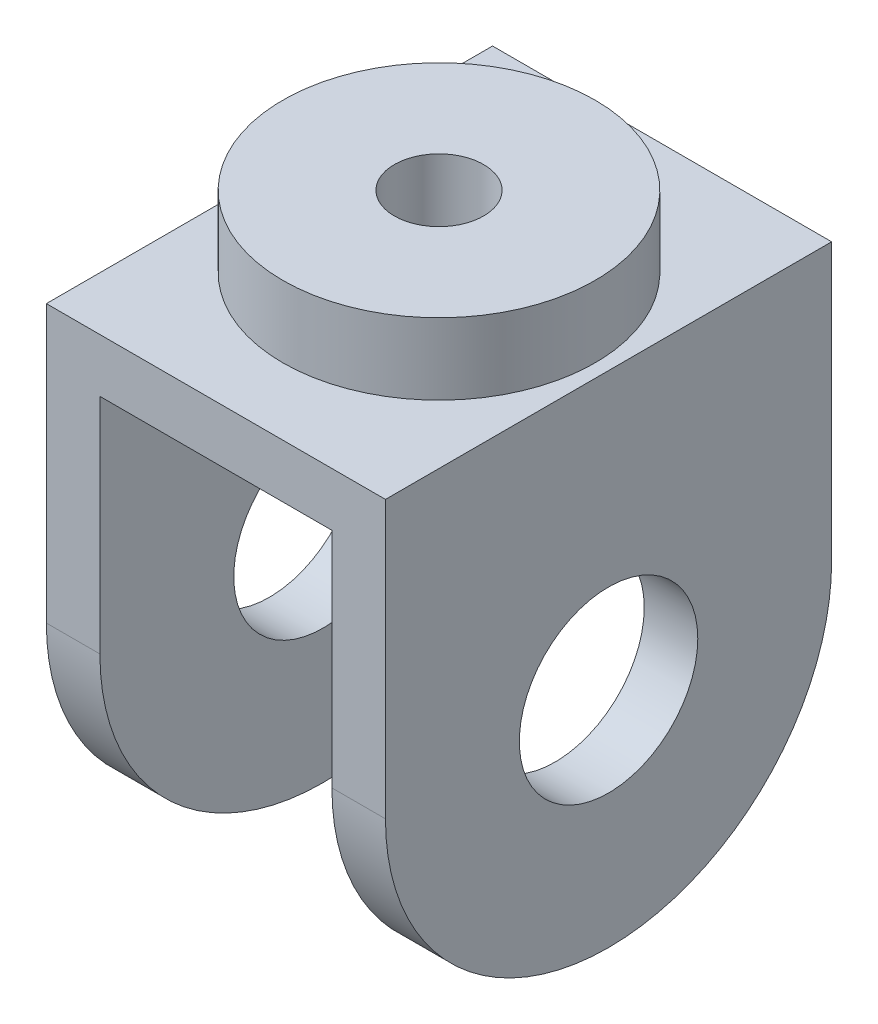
ISO-10303-21;
HEADER;
FILE_DESCRIPTION(('STEP AP214'),'2;1');
FILE_NAME('part.step','',(''),(''),'','','');
FILE_SCHEMA(('AUTOMOTIVE_DESIGN { 1 0 10303 214 1 1 1 1 }'));
ENDSEC;
DATA;
#1=APPLICATION_CONTEXT('core data for automotive mechanical design processes');
#2=APPLICATION_PROTOCOL_DEFINITION('international standard','automotive_design',2000,#1);
#3=PRODUCT_CONTEXT('',#1,'mechanical');
#4=PRODUCT('Part','Part','',(#3));
#5=PRODUCT_RELATED_PRODUCT_CATEGORY('part','',(#4));
#6=PRODUCT_DEFINITION_FORMATION('','',#4);
#7=PRODUCT_DEFINITION_CONTEXT('part definition',#1,'design');
#8=PRODUCT_DEFINITION('design','',#6,#7);
#9=PRODUCT_DEFINITION_SHAPE('','',#8);
#10=(LENGTH_UNIT() NAMED_UNIT(*) SI_UNIT(.MILLI.,.METRE.));
#11=(NAMED_UNIT(*) PLANE_ANGLE_UNIT() SI_UNIT($,.RADIAN.));
#12=(NAMED_UNIT(*) SI_UNIT($,.STERADIAN.) SOLID_ANGLE_UNIT());
#13=UNCERTAINTY_MEASURE_WITH_UNIT(LENGTH_MEASURE(1.E-05),#10,'distance_accuracy_value','');
#14=(GEOMETRIC_REPRESENTATION_CONTEXT(3) GLOBAL_UNCERTAINTY_ASSIGNED_CONTEXT((#13)) GLOBAL_UNIT_ASSIGNED_CONTEXT((#10,
#11,#12)) REPRESENTATION_CONTEXT('',''));
#15=CARTESIAN_POINT('',(0.,0.,0.));
#16=DIRECTION('',(0.,0.,1.));
#17=DIRECTION('',(1.,0.,0.));
#18=AXIS2_PLACEMENT_3D('',#15,#16,#17);
#19=CARTESIAN_POINT('',(0.,25.,0.));
#20=DIRECTION('',(0.,1.,0.));
#21=DIRECTION('',(0.,0.,1.));
#22=AXIS2_PLACEMENT_3D('',#19,#20,#21);
#23=PLANE('',#22);
#24=CARTESIAN_POINT('',(-13.,25.,0.));
#25=DIRECTION('',(0.,1.,0.));
#26=DIRECTION('',(0.,0.,1.));
#27=AXIS2_PLACEMENT_3D('',#24,#25,#26);
#28=CIRCLE('',#27,5.);
#29=CARTESIAN_POINT('',(-13.,25.,5.));
#30=VERTEX_POINT('',#29);
#31=EDGE_CURVE('E380',#30,#30,#28,.T.);
#32=ORIENTED_EDGE('',*,*,#31,.T.);
#33=EDGE_LOOP('',(#32));
#34=FACE_BOUND('',#33,.T.);
#35=DIRECTION('',(0.,0.,1.));
#36=VECTOR('',#35,1.);
#37=CARTESIAN_POINT('',(-26.,25.,25.));
#38=LINE('',#37,#36);
#39=CARTESIAN_POINT('',(-26.,25.,-25.));
#40=VERTEX_POINT('',#39);
#41=CARTESIAN_POINT('',(-26.,25.,25.));
#42=VERTEX_POINT('',#41);
#43=EDGE_CURVE('E307',#40,#42,#38,.T.);
#44=ORIENTED_EDGE('',*,*,#43,.F.);
#45=DIRECTION('',(-1.,0.,0.));
#46=VECTOR('',#45,1.);
#47=CARTESIAN_POINT('',(6.,25.,-25.));
#48=LINE('',#47,#46);
#49=CARTESIAN_POINT('',(0.,25.,-25.));
#50=VERTEX_POINT('',#49);
#51=EDGE_CURVE('E369',#50,#40,#48,.T.);
#52=ORIENTED_EDGE('',*,*,#51,.F.);
#53=DIRECTION('',(0.,0.,1.));
#54=VECTOR('',#53,1.);
#55=CARTESIAN_POINT('',(0.,25.,25.));
#56=LINE('',#55,#54);
#57=CARTESIAN_POINT('',(0.,25.,25.));
#58=VERTEX_POINT('',#57);
#59=EDGE_CURVE('E353',#50,#58,#56,.T.);
#60=ORIENTED_EDGE('',*,*,#59,.T.);
#61=DIRECTION('',(1.,0.,0.));
#62=VECTOR('',#61,1.);
#63=CARTESIAN_POINT('',(6.,25.,25.));
#64=LINE('',#63,#62);
#65=EDGE_CURVE('E368',#42,#58,#64,.T.);
#66=ORIENTED_EDGE('',*,*,#65,.F.);
#67=EDGE_LOOP('',(#44,#52,#60,#66));
#68=FACE_BOUND('',#67,.T.);
#69=ADVANCED_FACE('F292',(#34,#68),#23,.F.);
#70=CARTESIAN_POINT('',(6.,0.,0.));
#71=DIRECTION('',(1.,0.,0.));
#72=DIRECTION('',(0.,0.,-1.));
#73=AXIS2_PLACEMENT_3D('',#70,#71,#72);
#74=PLANE('',#73);
#75=DIRECTION('',(0.,1.,0.));
#76=VECTOR('',#75,1.);
#77=CARTESIAN_POINT('',(6.,0.,-25.));
#78=LINE('',#77,#76);
#79=CARTESIAN_POINT('',(6.,0.,-25.));
#80=VERTEX_POINT('',#79);
#81=CARTESIAN_POINT('',(6.,31.,-25.));
#82=VERTEX_POINT('',#81);
#83=EDGE_CURVE('E341',#80,#82,#78,.T.);
#84=ORIENTED_EDGE('',*,*,#83,.T.);
#85=DIRECTION('',(0.,0.,-1.));
#86=VECTOR('',#85,1.);
#87=CARTESIAN_POINT('',(6.,31.,25.));
#88=LINE('',#87,#86);
#89=CARTESIAN_POINT('',(6.,31.,25.));
#90=VERTEX_POINT('',#89);
#91=EDGE_CURVE('E372',#90,#82,#88,.T.);
#92=ORIENTED_EDGE('',*,*,#91,.F.);
#93=DIRECTION('',(0.,-1.,0.));
#94=VECTOR('',#93,1.);
#95=CARTESIAN_POINT('',(6.,0.,25.));
#96=LINE('',#95,#94);
#97=CARTESIAN_POINT('',(6.,0.,25.));
#98=VERTEX_POINT('',#97);
#99=EDGE_CURVE('E393',#90,#98,#96,.T.);
#100=ORIENTED_EDGE('',*,*,#99,.T.);
#101=CARTESIAN_POINT('',(6.,0.,0.));
#102=DIRECTION('',(1.,0.,0.));
#103=DIRECTION('',(0.,0.,-1.));
#104=AXIS2_PLACEMENT_3D('',#101,#102,#103);
#105=CIRCLE('',#104,25.);
#106=EDGE_CURVE('E316',#98,#80,#105,.T.);
#107=ORIENTED_EDGE('',*,*,#106,.T.);
#108=EDGE_LOOP('',(#84,#92,#100,#107));
#109=FACE_BOUND('',#108,.T.);
#110=CARTESIAN_POINT('',(6.,0.,0.));
#111=DIRECTION('',(1.,0.,0.));
#112=DIRECTION('',(0.,0.,-1.));
#113=AXIS2_PLACEMENT_3D('',#110,#111,#112);
#114=CIRCLE('',#113,10.);
#115=CARTESIAN_POINT('',(6.,0.,-10.));
#116=VERTEX_POINT('',#115);
#117=EDGE_CURVE('E355',#116,#116,#114,.T.);
#118=ORIENTED_EDGE('',*,*,#117,.F.);
#119=EDGE_LOOP('',(#118));
#120=FACE_BOUND('',#119,.T.);
#121=ADVANCED_FACE('F391',(#109,#120),#74,.T.);
#122=CARTESIAN_POINT('',(0.,0.,0.));
#123=DIRECTION('',(1.,0.,0.));
#124=DIRECTION('',(0.,0.,-1.));
#125=AXIS2_PLACEMENT_3D('',#122,#123,#124);
#126=PLANE('',#125);
#127=DIRECTION('',(0.,1.,0.));
#128=VECTOR('',#127,1.);
#129=CARTESIAN_POINT('',(0.,0.,-25.));
#130=LINE('',#129,#128);
#131=CARTESIAN_POINT('',(0.,0.,-25.));
#132=VERTEX_POINT('',#131);
#133=EDGE_CURVE('E347',#132,#50,#130,.T.);
#134=ORIENTED_EDGE('',*,*,#133,.F.);
#135=CARTESIAN_POINT('',(0.,0.,0.));
#136=DIRECTION('',(1.,0.,0.));
#137=DIRECTION('',(0.,0.,-1.));
#138=AXIS2_PLACEMENT_3D('',#135,#136,#137);
#139=CIRCLE('',#138,25.);
#140=CARTESIAN_POINT('',(0.,0.,25.));
#141=VERTEX_POINT('',#140);
#142=EDGE_CURVE('E335',#141,#132,#139,.T.);
#143=ORIENTED_EDGE('',*,*,#142,.F.);
#144=DIRECTION('',(0.,-1.,0.));
#145=VECTOR('',#144,1.);
#146=CARTESIAN_POINT('',(0.,0.,25.));
#147=LINE('',#146,#145);
#148=EDGE_CURVE('E345',#58,#141,#147,.T.);
#149=ORIENTED_EDGE('',*,*,#148,.F.);
#150=ORIENTED_EDGE('',*,*,#59,.F.);
#151=EDGE_LOOP('',(#134,#143,#149,#150));
#152=FACE_BOUND('',#151,.T.);
#153=CARTESIAN_POINT('',(0.,0.,0.));
#154=DIRECTION('',(1.,0.,0.));
#155=DIRECTION('',(0.,0.,-1.));
#156=AXIS2_PLACEMENT_3D('',#153,#154,#155);
#157=CIRCLE('',#156,10.);
#158=CARTESIAN_POINT('',(0.,0.,-10.));
#159=VERTEX_POINT('',#158);
#160=EDGE_CURVE('E356',#159,#159,#157,.T.);
#161=ORIENTED_EDGE('',*,*,#160,.T.);
#162=EDGE_LOOP('',(#161));
#163=FACE_BOUND('',#162,.T.);
#164=ADVANCED_FACE('F346',(#152,#163),#126,.F.);
#165=CARTESIAN_POINT('',(6.,0.,-25.));
#166=DIRECTION('',(0.,0.,1.));
#167=DIRECTION('',(0.,-1.,0.));
#168=AXIS2_PLACEMENT_3D('',#165,#166,#167);
#169=PLANE('',#168);
#170=ORIENTED_EDGE('',*,*,#133,.T.);
#171=ORIENTED_EDGE('',*,*,#51,.T.);
#172=DIRECTION('',(0.,1.,0.));
#173=VECTOR('',#172,1.);
#174=CARTESIAN_POINT('',(-26.,0.,-25.));
#175=LINE('',#174,#173);
#176=CARTESIAN_POINT('',(-26.,0.,-25.));
#177=VERTEX_POINT('',#176);
#178=EDGE_CURVE('E431',#177,#40,#175,.T.);
#179=ORIENTED_EDGE('',*,*,#178,.F.);
#180=DIRECTION('',(1.,0.,0.));
#181=VECTOR('',#180,1.);
#182=CARTESIAN_POINT('',(-32.,0.,-25.));
#183=LINE('',#182,#181);
#184=CARTESIAN_POINT('',(-32.,0.,-25.));
#185=VERTEX_POINT('',#184);
#186=EDGE_CURVE('E417',#185,#177,#183,.T.);
#187=ORIENTED_EDGE('',*,*,#186,.F.);
#188=DIRECTION('',(0.,-1.,0.));
#189=VECTOR('',#188,1.);
#190=CARTESIAN_POINT('',(-32.,31.,-25.));
#191=LINE('',#190,#189);
#192=CARTESIAN_POINT('',(-32.,31.,-25.));
#193=VERTEX_POINT('',#192);
#194=EDGE_CURVE('E387',#193,#185,#191,.T.);
#195=ORIENTED_EDGE('',*,*,#194,.F.);
#196=DIRECTION('',(-1.,0.,0.));
#197=VECTOR('',#196,1.);
#198=CARTESIAN_POINT('',(6.,31.,-25.));
#199=LINE('',#198,#197);
#200=EDGE_CURVE('E406',#82,#193,#199,.T.);
#201=ORIENTED_EDGE('',*,*,#200,.F.);
#202=ORIENTED_EDGE('',*,*,#83,.F.);
#203=DIRECTION('',(-1.,0.,0.));
#204=VECTOR('',#203,1.);
#205=CARTESIAN_POINT('',(6.,0.,-25.));
#206=LINE('',#205,#204);
#207=EDGE_CURVE('E333',#80,#132,#206,.T.);
#208=ORIENTED_EDGE('',*,*,#207,.T.);
#209=EDGE_LOOP('',(#170,#171,#179,#187,#195,#201,#202,#208));
#210=FACE_BOUND('',#209,.T.);
#211=ADVANCED_FACE('F291',(#210),#169,.F.);
#212=CARTESIAN_POINT('',(6.,0.,25.));
#213=DIRECTION('',(0.,0.,-1.));
#214=DIRECTION('',(-1.,0.,0.));
#215=AXIS2_PLACEMENT_3D('',#212,#213,#214);
#216=PLANE('',#215);
#217=ORIENTED_EDGE('',*,*,#148,.T.);
#218=DIRECTION('',(-1.,0.,0.));
#219=VECTOR('',#218,1.);
#220=CARTESIAN_POINT('',(6.,0.,25.));
#221=LINE('',#220,#219);
#222=EDGE_CURVE('E293',#98,#141,#221,.T.);
#223=ORIENTED_EDGE('',*,*,#222,.F.);
#224=ORIENTED_EDGE('',*,*,#99,.F.);
#225=DIRECTION('',(1.,0.,0.));
#226=VECTOR('',#225,1.);
#227=CARTESIAN_POINT('',(6.,31.,25.));
#228=LINE('',#227,#226);
#229=CARTESIAN_POINT('',(-32.,31.,25.));
#230=VERTEX_POINT('',#229);
#231=EDGE_CURVE('E379',#230,#90,#228,.T.);
#232=ORIENTED_EDGE('',*,*,#231,.F.);
#233=DIRECTION('',(0.,-1.,0.));
#234=VECTOR('',#233,1.);
#235=CARTESIAN_POINT('',(-32.,31.,25.));
#236=LINE('',#235,#234);
#237=CARTESIAN_POINT('',(-32.,0.,25.));
#238=VERTEX_POINT('',#237);
#239=EDGE_CURVE('E382',#230,#238,#236,.T.);
#240=ORIENTED_EDGE('',*,*,#239,.T.);
#241=DIRECTION('',(1.,0.,0.));
#242=VECTOR('',#241,1.);
#243=CARTESIAN_POINT('',(-32.,0.,25.));
#244=LINE('',#243,#242);
#245=CARTESIAN_POINT('',(-26.,0.,25.));
#246=VERTEX_POINT('',#245);
#247=EDGE_CURVE('E419',#238,#246,#244,.T.);
#248=ORIENTED_EDGE('',*,*,#247,.T.);
#249=DIRECTION('',(0.,-1.,0.));
#250=VECTOR('',#249,1.);
#251=CARTESIAN_POINT('',(-26.,0.,25.));
#252=LINE('',#251,#250);
#253=EDGE_CURVE('E422',#42,#246,#252,.T.);
#254=ORIENTED_EDGE('',*,*,#253,.F.);
#255=ORIENTED_EDGE('',*,*,#65,.T.);
#256=EDGE_LOOP('',(#217,#223,#224,#232,#240,#248,#254,#255));
#257=FACE_BOUND('',#256,.T.);
#258=ADVANCED_FACE('F361',(#257),#216,.F.);
#259=CARTESIAN_POINT('',(6.,0.,0.));
#260=DIRECTION('',(-1.,0.,0.));
#261=DIRECTION('',(0.,0.,1.));
#262=AXIS2_PLACEMENT_3D('',#259,#260,#261);
#263=CYLINDRICAL_SURFACE('',#262,25.);
#264=ORIENTED_EDGE('',*,*,#142,.T.);
#265=ORIENTED_EDGE('',*,*,#207,.F.);
#266=ORIENTED_EDGE('',*,*,#106,.F.);
#267=ORIENTED_EDGE('',*,*,#222,.T.);
#268=EDGE_LOOP('',(#264,#265,#266,#267));
#269=FACE_BOUND('',#268,.T.);
#270=ADVANCED_FACE('F331',(#269),#263,.T.);
#271=CARTESIAN_POINT('',(6.,0.,0.));
#272=DIRECTION('',(-1.,0.,0.));
#273=DIRECTION('',(0.,0.,1.));
#274=AXIS2_PLACEMENT_3D('',#271,#272,#273);
#275=CYLINDRICAL_SURFACE('',#274,10.);
#276=ORIENTED_EDGE('',*,*,#117,.T.);
#277=EDGE_LOOP('',(#276));
#278=FACE_BOUND('',#277,.T.);
#279=ORIENTED_EDGE('',*,*,#160,.F.);
#280=EDGE_LOOP('',(#279));
#281=FACE_BOUND('',#280,.T.);
#282=ADVANCED_FACE('F500',(#278,#281),#275,.F.);
#283=CARTESIAN_POINT('',(-32.,31.,25.));
#284=DIRECTION('',(1.,0.,0.));
#285=DIRECTION('',(0.,0.,-1.));
#286=AXIS2_PLACEMENT_3D('',#283,#284,#285);
#287=PLANE('',#286);
#288=ORIENTED_EDGE('',*,*,#194,.T.);
#289=CARTESIAN_POINT('',(-32.,0.,0.));
#290=DIRECTION('',(1.,0.,0.));
#291=DIRECTION('',(0.,0.,-1.));
#292=AXIS2_PLACEMENT_3D('',#289,#290,#291);
#293=CIRCLE('',#292,25.);
#294=EDGE_CURVE('E421',#238,#185,#293,.T.);
#295=ORIENTED_EDGE('',*,*,#294,.F.);
#296=ORIENTED_EDGE('',*,*,#239,.F.);
#297=DIRECTION('',(0.,0.,1.));
#298=VECTOR('',#297,1.);
#299=CARTESIAN_POINT('',(-32.,31.,25.));
#300=LINE('',#299,#298);
#301=EDGE_CURVE('E408',#193,#230,#300,.T.);
#302=ORIENTED_EDGE('',*,*,#301,.F.);
#303=EDGE_LOOP('',(#288,#295,#296,#302));
#304=FACE_BOUND('',#303,.T.);
#305=CARTESIAN_POINT('',(-32.,0.,0.));
#306=DIRECTION('',(1.,0.,0.));
#307=DIRECTION('',(0.,0.,-1.));
#308=AXIS2_PLACEMENT_3D('',#305,#306,#307);
#309=CIRCLE('',#308,10.);
#310=CARTESIAN_POINT('',(-32.,0.,-10.));
#311=VERTEX_POINT('',#310);
#312=EDGE_CURVE('E433',#311,#311,#309,.T.);
#313=ORIENTED_EDGE('',*,*,#312,.T.);
#314=EDGE_LOOP('',(#313));
#315=FACE_BOUND('',#314,.T.);
#316=ADVANCED_FACE('F445',(#304,#315),#287,.F.);
#317=CARTESIAN_POINT('',(0.,31.,0.));
#318=DIRECTION('',(0.,1.,0.));
#319=DIRECTION('',(0.,0.,1.));
#320=AXIS2_PLACEMENT_3D('',#317,#318,#319);
#321=PLANE('',#320);
#322=CARTESIAN_POINT('',(-13.,31.,0.));
#323=DIRECTION('',(0.,1.,0.));
#324=DIRECTION('',(0.,0.,1.));
#325=AXIS2_PLACEMENT_3D('',#322,#323,#324);
#326=CIRCLE('',#325,17.5);
#327=CARTESIAN_POINT('',(-13.,31.,17.5));
#328=VERTEX_POINT('',#327);
#329=EDGE_CURVE('E12',#328,#328,#326,.T.);
#330=ORIENTED_EDGE('',*,*,#329,.F.);
#331=EDGE_LOOP('',(#330));
#332=FACE_BOUND('',#331,.T.);
#333=ORIENTED_EDGE('',*,*,#91,.T.);
#334=ORIENTED_EDGE('',*,*,#200,.T.);
#335=ORIENTED_EDGE('',*,*,#301,.T.);
#336=ORIENTED_EDGE('',*,*,#231,.T.);
#337=EDGE_LOOP('',(#333,#334,#335,#336));
#338=FACE_BOUND('',#337,.T.);
#339=ADVANCED_FACE('F405',(#332,#338),#321,.T.);
#340=CARTESIAN_POINT('',(-13.,39.,0.));
#341=DIRECTION('',(0.,-1.,0.));
#342=DIRECTION('',(0.,0.,-1.));
#343=AXIS2_PLACEMENT_3D('',#340,#341,#342);
#344=CYLINDRICAL_SURFACE('',#343,17.5);
#345=CARTESIAN_POINT('',(-13.,39.,0.));
#346=DIRECTION('',(0.,1.,0.));
#347=DIRECTION('',(0.,0.,1.));
#348=AXIS2_PLACEMENT_3D('',#345,#346,#347);
#349=CIRCLE('',#348,17.5);
#350=CARTESIAN_POINT('',(-13.,39.,17.5));
#351=VERTEX_POINT('',#350);
#352=EDGE_CURVE('E375',#351,#351,#349,.T.);
#353=ORIENTED_EDGE('',*,*,#352,.F.);
#354=EDGE_LOOP('',(#353));
#355=FACE_BOUND('',#354,.T.);
#356=ORIENTED_EDGE('',*,*,#329,.T.);
#357=EDGE_LOOP('',(#356));
#358=FACE_BOUND('',#357,.T.);
#359=ADVANCED_FACE('F561',(#355,#358),#344,.T.);
#360=CARTESIAN_POINT('',(-13.,39.,0.));
#361=DIRECTION('',(0.,1.,0.));
#362=DIRECTION('',(0.,0.,1.));
#363=AXIS2_PLACEMENT_3D('',#360,#361,#362);
#364=PLANE('',#363);
#365=CARTESIAN_POINT('',(-13.,39.,0.));
#366=DIRECTION('',(0.,1.,0.));
#367=DIRECTION('',(0.,0.,1.));
#368=AXIS2_PLACEMENT_3D('',#365,#366,#367);
#369=CIRCLE('',#368,5.);
#370=CARTESIAN_POINT('',(-13.,39.,5.));
#371=VERTEX_POINT('',#370);
#372=EDGE_CURVE('E413',#371,#371,#369,.T.);
#373=ORIENTED_EDGE('',*,*,#372,.F.);
#374=EDGE_LOOP('',(#373));
#375=FACE_BOUND('',#374,.T.);
#376=ORIENTED_EDGE('',*,*,#352,.T.);
#377=EDGE_LOOP('',(#376));
#378=FACE_BOUND('',#377,.T.);
#379=ADVANCED_FACE('F485',(#375,#378),#364,.T.);
#380=CARTESIAN_POINT('',(-13.,-25.,0.));
#381=DIRECTION('',(0.,1.,0.));
#382=DIRECTION('',(0.,0.,1.));
#383=AXIS2_PLACEMENT_3D('',#380,#381,#382);
#384=CYLINDRICAL_SURFACE('',#383,5.);
#385=ORIENTED_EDGE('',*,*,#372,.T.);
#386=EDGE_LOOP('',(#385));
#387=FACE_BOUND('',#386,.T.);
#388=ORIENTED_EDGE('',*,*,#31,.F.);
#389=EDGE_LOOP('',(#388));
#390=FACE_BOUND('',#389,.T.);
#391=ADVANCED_FACE('F478',(#387,#390),#384,.F.);
#392=CARTESIAN_POINT('',(-32.,0.,0.));
#393=DIRECTION('',(1.,0.,0.));
#394=DIRECTION('',(0.,0.,-1.));
#395=AXIS2_PLACEMENT_3D('',#392,#393,#394);
#396=CYLINDRICAL_SURFACE('',#395,25.);
#397=CARTESIAN_POINT('',(-26.,0.,0.));
#398=DIRECTION('',(1.,0.,0.));
#399=DIRECTION('',(0.,0.,-1.));
#400=AXIS2_PLACEMENT_3D('',#397,#398,#399);
#401=CIRCLE('',#400,25.);
#402=EDGE_CURVE('E428',#246,#177,#401,.T.);
#403=ORIENTED_EDGE('',*,*,#402,.F.);
#404=ORIENTED_EDGE('',*,*,#247,.F.);
#405=ORIENTED_EDGE('',*,*,#294,.T.);
#406=ORIENTED_EDGE('',*,*,#186,.T.);
#407=EDGE_LOOP('',(#403,#404,#405,#406));
#408=FACE_BOUND('',#407,.T.);
#409=ADVANCED_FACE('F452',(#408),#396,.T.);
#410=CARTESIAN_POINT('',(-26.,0.,0.));
#411=DIRECTION('',(-1.,0.,0.));
#412=DIRECTION('',(0.,0.,-1.));
#413=AXIS2_PLACEMENT_3D('',#410,#411,#412);
#414=PLANE('',#413);
#415=CARTESIAN_POINT('',(-26.,0.,0.));
#416=DIRECTION('',(1.,0.,0.));
#417=DIRECTION('',(0.,0.,-1.));
#418=AXIS2_PLACEMENT_3D('',#415,#416,#417);
#419=CIRCLE('',#418,10.);
#420=CARTESIAN_POINT('',(-26.,0.,-10.));
#421=VERTEX_POINT('',#420);
#422=EDGE_CURVE('E436',#421,#421,#419,.T.);
#423=ORIENTED_EDGE('',*,*,#422,.F.);
#424=EDGE_LOOP('',(#423));
#425=FACE_BOUND('',#424,.T.);
#426=ORIENTED_EDGE('',*,*,#178,.T.);
#427=ORIENTED_EDGE('',*,*,#43,.T.);
#428=ORIENTED_EDGE('',*,*,#253,.T.);
#429=ORIENTED_EDGE('',*,*,#402,.T.);
#430=EDGE_LOOP('',(#426,#427,#428,#429));
#431=FACE_BOUND('',#430,.T.);
#432=ADVANCED_FACE('F450',(#425,#431),#414,.F.);
#433=CARTESIAN_POINT('',(-32.,0.,0.));
#434=DIRECTION('',(1.,0.,0.));
#435=DIRECTION('',(0.,0.,-1.));
#436=AXIS2_PLACEMENT_3D('',#433,#434,#435);
#437=CYLINDRICAL_SURFACE('',#436,10.);
#438=ORIENTED_EDGE('',*,*,#312,.F.);
#439=EDGE_LOOP('',(#438));
#440=FACE_BOUND('',#439,.T.);
#441=ORIENTED_EDGE('',*,*,#422,.T.);
#442=EDGE_LOOP('',(#441));
#443=FACE_BOUND('',#442,.T.);
#444=ADVANCED_FACE('F441',(#440,#443),#437,.F.);
#445=CLOSED_SHELL('',(#69,#121,#164,#211,#258,#270,#282,#316,#339,#359,#379,#391,#409,#432,#444));
#446=MANIFOLD_SOLID_BREP('B2',#445);
#447=ADVANCED_BREP_SHAPE_REPRESENTATION('',(#18,#446),#14);
#448=SHAPE_DEFINITION_REPRESENTATION(#9,#447);
ENDSEC;
END-ISO-10303-21;
